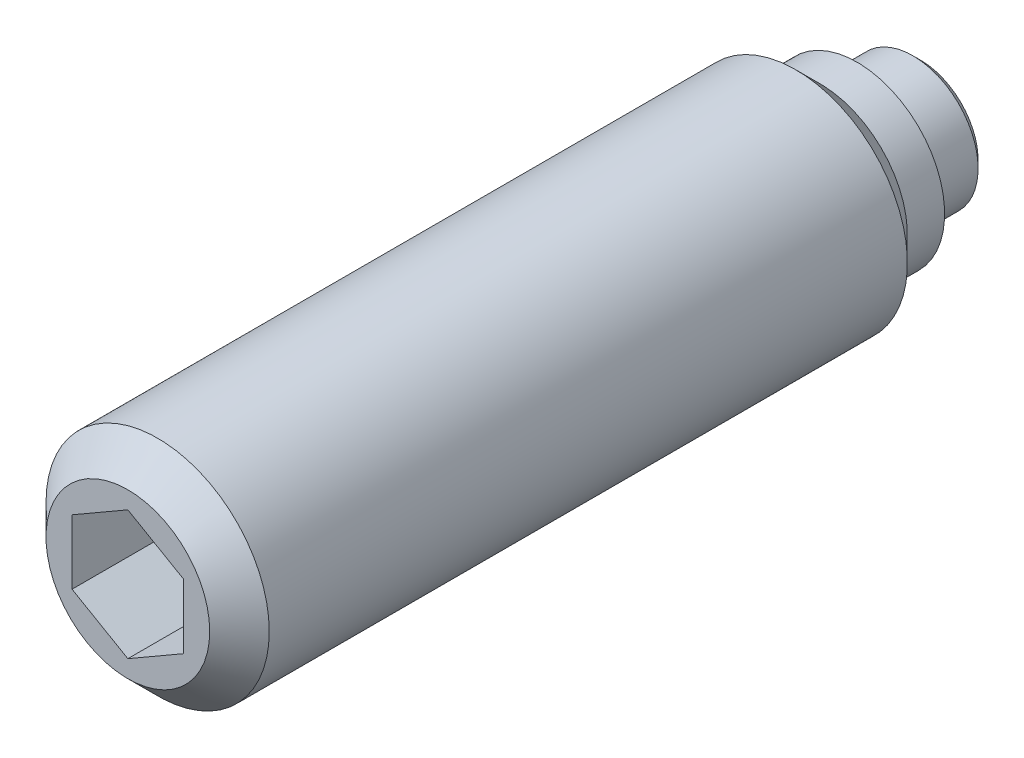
ISO-10303-21;
HEADER;
FILE_DESCRIPTION(('STEP AP214'),'2;1');
FILE_NAME('part.step','',(''),(''),'','','');
FILE_SCHEMA(('AUTOMOTIVE_DESIGN { 1 0 10303 214 1 1 1 1 }'));
ENDSEC;
DATA;
#1=APPLICATION_CONTEXT('core data for automotive mechanical design processes');
#2=APPLICATION_PROTOCOL_DEFINITION('international standard','automotive_design',2000,#1);
#3=PRODUCT_CONTEXT('',#1,'mechanical');
#4=PRODUCT('Part','Part','',(#3));
#5=PRODUCT_RELATED_PRODUCT_CATEGORY('part','',(#4));
#6=PRODUCT_DEFINITION_FORMATION('','',#4);
#7=PRODUCT_DEFINITION_CONTEXT('part definition',#1,'design');
#8=PRODUCT_DEFINITION('design','',#6,#7);
#9=PRODUCT_DEFINITION_SHAPE('','',#8);
#10=(LENGTH_UNIT() NAMED_UNIT(*) SI_UNIT(.MILLI.,.METRE.));
#11=(NAMED_UNIT(*) PLANE_ANGLE_UNIT() SI_UNIT($,.RADIAN.));
#12=(NAMED_UNIT(*) SI_UNIT($,.STERADIAN.) SOLID_ANGLE_UNIT());
#13=UNCERTAINTY_MEASURE_WITH_UNIT(LENGTH_MEASURE(1.E-05),#10,'distance_accuracy_value','');
#14=(GEOMETRIC_REPRESENTATION_CONTEXT(3) GLOBAL_UNCERTAINTY_ASSIGNED_CONTEXT((#13)) GLOBAL_UNIT_ASSIGNED_CONTEXT((#10,
#11,#12)) REPRESENTATION_CONTEXT('',''));
#15=CARTESIAN_POINT('',(0.,0.,0.));
#16=DIRECTION('',(0.,0.,1.));
#17=DIRECTION('',(1.,0.,0.));
#18=AXIS2_PLACEMENT_3D('',#15,#16,#17);
#19=CARTESIAN_POINT('',(0.,0.,0.));
#20=DIRECTION('',(0.,0.,-1.));
#21=DIRECTION('',(-1.,0.,0.));
#22=AXIS2_PLACEMENT_3D('',#19,#20,#21);
#23=CYLINDRICAL_SURFACE('',#22,1.75);
#24=CARTESIAN_POINT('',(0.,0.,0.2));
#25=DIRECTION('',(0.,0.,-1.));
#26=DIRECTION('',(-1.,0.,0.));
#27=AXIS2_PLACEMENT_3D('',#24,#25,#26);
#28=CIRCLE('',#27,1.75);
#29=CARTESIAN_POINT('',(-1.75,0.,0.2));
#30=VERTEX_POINT('',#29);
#31=EDGE_CURVE('E133',#30,#30,#28,.T.);
#32=ORIENTED_EDGE('',*,*,#31,.F.);
#33=EDGE_LOOP('',(#32));
#34=FACE_BOUND('',#33,.T.);
#35=CARTESIAN_POINT('',(0.,0.,1.7));
#36=DIRECTION('',(0.,0.,-1.));
#37=DIRECTION('',(-1.,0.,0.));
#38=AXIS2_PLACEMENT_3D('',#35,#36,#37);
#39=CIRCLE('',#38,1.75);
#40=CARTESIAN_POINT('',(-1.75,0.,1.7));
#41=VERTEX_POINT('',#40);
#42=EDGE_CURVE('E127',#41,#41,#39,.T.);
#43=ORIENTED_EDGE('',*,*,#42,.T.);
#44=EDGE_LOOP('',(#43));
#45=FACE_BOUND('',#44,.T.);
#46=ADVANCED_FACE('F14',(#34,#45),#23,.T.);
#47=CARTESIAN_POINT('',(0.,0.,0.2));
#48=DIRECTION('',(0.,0.,1.));
#49=DIRECTION('',(1.,0.,0.));
#50=AXIS2_PLACEMENT_3D('',#47,#48,#49);
#51=CONICAL_SURFACE('',#50,1.75,0.785398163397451);
#52=CARTESIAN_POINT('',(0.,0.,0.));
#53=DIRECTION('',(0.,0.,-1.));
#54=DIRECTION('',(-1.,0.,0.));
#55=AXIS2_PLACEMENT_3D('',#52,#53,#54);
#56=CIRCLE('',#55,1.55);
#57=CARTESIAN_POINT('',(-1.55,0.,0.));
#58=VERTEX_POINT('',#57);
#59=EDGE_CURVE('E130',#58,#58,#56,.T.);
#60=ORIENTED_EDGE('',*,*,#59,.F.);
#61=EDGE_LOOP('',(#60));
#62=FACE_BOUND('',#61,.T.);
#63=ORIENTED_EDGE('',*,*,#31,.T.);
#64=EDGE_LOOP('',(#63));
#65=FACE_BOUND('',#64,.T.);
#66=ADVANCED_FACE('F159',(#62,#65),#51,.T.);
#67=CARTESIAN_POINT('',(0.,1.55,0.));
#68=DIRECTION('',(0.,0.,1.));
#69=DIRECTION('',(1.,0.,0.));
#70=AXIS2_PLACEMENT_3D('',#67,#68,#69);
#71=PLANE('',#70);
#72=ORIENTED_EDGE('',*,*,#59,.T.);
#73=EDGE_LOOP('',(#72));
#74=FACE_BOUND('',#73,.T.);
#75=ADVANCED_FACE('F165',(#74),#71,.F.);
#76=CARTESIAN_POINT('',(0.,0.,1.7));
#77=DIRECTION('',(0.,0.,-1.));
#78=DIRECTION('',(-1.,0.,0.));
#79=AXIS2_PLACEMENT_3D('',#76,#77,#78);
#80=CYLINDRICAL_SURFACE('',#79,3.);
#81=CARTESIAN_POINT('',(0.,0.,3.35));
#82=DIRECTION('',(0.,0.,-1.));
#83=DIRECTION('',(-1.,0.,0.));
#84=AXIS2_PLACEMENT_3D('',#81,#82,#83);
#85=CIRCLE('',#84,3.);
#86=CARTESIAN_POINT('',(-3.,0.,3.35));
#87=VERTEX_POINT('',#86);
#88=EDGE_CURVE('E9',#87,#87,#85,.T.);
#89=ORIENTED_EDGE('',*,*,#88,.F.);
#90=EDGE_LOOP('',(#89));
#91=FACE_BOUND('',#90,.T.);
#92=CARTESIAN_POINT('',(0.,0.,20.5));
#93=DIRECTION('',(0.,0.,1.));
#94=DIRECTION('',(1.,0.,0.));
#95=AXIS2_PLACEMENT_3D('',#92,#93,#94);
#96=CIRCLE('',#95,3.);
#97=CARTESIAN_POINT('',(3.,0.,20.5));
#98=VERTEX_POINT('',#97);
#99=EDGE_CURVE('E124',#98,#98,#96,.T.);
#100=ORIENTED_EDGE('',*,*,#99,.F.);
#101=EDGE_LOOP('',(#100));
#102=FACE_BOUND('',#101,.T.);
#103=ADVANCED_FACE('F16',(#91,#102),#80,.T.);
#104=CARTESIAN_POINT('',(0.,2.35,1.7));
#105=DIRECTION('',(0.,0.,1.));
#106=DIRECTION('',(1.,0.,0.));
#107=AXIS2_PLACEMENT_3D('',#104,#105,#106);
#108=PLANE('',#107);
#109=CARTESIAN_POINT('',(0.,0.,1.7));
#110=DIRECTION('',(0.,0.,-1.));
#111=DIRECTION('',(-1.,0.,0.));
#112=AXIS2_PLACEMENT_3D('',#109,#110,#111);
#113=CIRCLE('',#112,2.35);
#114=CARTESIAN_POINT('',(-2.35,0.,1.7));
#115=VERTEX_POINT('',#114);
#116=EDGE_CURVE('E136',#115,#115,#113,.T.);
#117=ORIENTED_EDGE('',*,*,#116,.T.);
#118=EDGE_LOOP('',(#117));
#119=FACE_BOUND('',#118,.T.);
#120=ORIENTED_EDGE('',*,*,#42,.F.);
#121=EDGE_LOOP('',(#120));
#122=FACE_BOUND('',#121,.T.);
#123=ADVANCED_FACE('F156',(#119,#122),#108,.F.);
#124=CARTESIAN_POINT('',(0.,0.,1.7));
#125=DIRECTION('',(0.,0.,-1.));
#126=DIRECTION('',(-1.,0.,0.));
#127=AXIS2_PLACEMENT_3D('',#124,#125,#126);
#128=CYLINDRICAL_SURFACE('',#127,2.35);
#129=CARTESIAN_POINT('',(0.,0.,2.7));
#130=DIRECTION('',(0.,0.,-1.));
#131=DIRECTION('',(-1.,0.,0.));
#132=AXIS2_PLACEMENT_3D('',#129,#130,#131);
#133=CIRCLE('',#132,2.35);
#134=CARTESIAN_POINT('',(-2.35,0.,2.7));
#135=VERTEX_POINT('',#134);
#136=EDGE_CURVE('E22',#135,#135,#133,.T.);
#137=ORIENTED_EDGE('',*,*,#136,.T.);
#138=EDGE_LOOP('',(#137));
#139=FACE_BOUND('',#138,.T.);
#140=ORIENTED_EDGE('',*,*,#116,.F.);
#141=EDGE_LOOP('',(#140));
#142=FACE_BOUND('',#141,.T.);
#143=ADVANCED_FACE('F141',(#139,#142),#128,.T.);
#144=CARTESIAN_POINT('',(0.,0.,3.35));
#145=DIRECTION('',(0.,0.,1.));
#146=DIRECTION('',(1.,0.,0.));
#147=AXIS2_PLACEMENT_3D('',#144,#145,#146);
#148=CONICAL_SURFACE('',#147,3.,0.785398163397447);
#149=ORIENTED_EDGE('',*,*,#88,.T.);
#150=EDGE_LOOP('',(#149));
#151=FACE_BOUND('',#150,.T.);
#152=ORIENTED_EDGE('',*,*,#136,.F.);
#153=EDGE_LOOP('',(#152));
#154=FACE_BOUND('',#153,.T.);
#155=ADVANCED_FACE('F144',(#151,#154),#148,.T.);
#156=CARTESIAN_POINT('',(0.,-2.2,21.3));
#157=DIRECTION('',(0.,0.,1.));
#158=DIRECTION('',(1.,0.,0.));
#159=AXIS2_PLACEMENT_3D('',#156,#157,#158);
#160=PLANE('',#159);
#161=DIRECTION('',(0.866025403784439,-0.5,0.));
#162=VECTOR('',#161,1.);
#163=CARTESIAN_POINT('',(-1.5,-0.866025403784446,21.3));
#164=LINE('',#163,#162);
#165=CARTESIAN_POINT('',(-1.5,-0.866025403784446,21.3));
#166=VERTEX_POINT('',#165);
#167=CARTESIAN_POINT('',(0.,-1.73205080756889,21.3));
#168=VERTEX_POINT('',#167);
#169=EDGE_CURVE('E29',#166,#168,#164,.T.);
#170=ORIENTED_EDGE('',*,*,#169,.F.);
#171=DIRECTION('',(0.,-1.,0.));
#172=VECTOR('',#171,1.);
#173=CARTESIAN_POINT('',(-1.5,0.866025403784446,21.3));
#174=LINE('',#173,#172);
#175=CARTESIAN_POINT('',(-1.5,0.866025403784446,21.3));
#176=VERTEX_POINT('',#175);
#177=EDGE_CURVE('E112',#176,#166,#174,.T.);
#178=ORIENTED_EDGE('',*,*,#177,.F.);
#179=DIRECTION('',(-0.866025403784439,-0.5,0.));
#180=VECTOR('',#179,1.);
#181=CARTESIAN_POINT('',(0.,1.73205080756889,21.3));
#182=LINE('',#181,#180);
#183=CARTESIAN_POINT('',(0.,1.73205080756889,21.3));
#184=VERTEX_POINT('',#183);
#185=EDGE_CURVE('E110',#184,#176,#182,.T.);
#186=ORIENTED_EDGE('',*,*,#185,.F.);
#187=DIRECTION('',(-0.866025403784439,0.5,0.));
#188=VECTOR('',#187,1.);
#189=CARTESIAN_POINT('',(1.5,0.866025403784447,21.3));
#190=LINE('',#189,#188);
#191=CARTESIAN_POINT('',(1.5,0.866025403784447,21.3));
#192=VERTEX_POINT('',#191);
#193=EDGE_CURVE('E77',#192,#184,#190,.T.);
#194=ORIENTED_EDGE('',*,*,#193,.F.);
#195=DIRECTION('',(0.,1.,0.));
#196=VECTOR('',#195,1.);
#197=CARTESIAN_POINT('',(1.5,-0.866025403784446,21.3));
#198=LINE('',#197,#196);
#199=CARTESIAN_POINT('',(1.5,-0.866025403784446,21.3));
#200=VERTEX_POINT('',#199);
#201=EDGE_CURVE('E106',#200,#192,#198,.T.);
#202=ORIENTED_EDGE('',*,*,#201,.F.);
#203=DIRECTION('',(0.866025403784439,0.5,0.));
#204=VECTOR('',#203,1.);
#205=CARTESIAN_POINT('',(0.,-1.73205080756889,21.3));
#206=LINE('',#205,#204);
#207=EDGE_CURVE('E103',#168,#200,#206,.T.);
#208=ORIENTED_EDGE('',*,*,#207,.F.);
#209=EDGE_LOOP('',(#170,#178,#186,#194,#202,#208));
#210=FACE_BOUND('',#209,.T.);
#211=CARTESIAN_POINT('',(0.,0.,21.3));
#212=DIRECTION('',(0.,0.,1.));
#213=DIRECTION('',(1.,0.,0.));
#214=AXIS2_PLACEMENT_3D('',#211,#212,#213);
#215=CIRCLE('',#214,2.2);
#216=CARTESIAN_POINT('',(2.2,0.,21.3));
#217=VERTEX_POINT('',#216);
#218=EDGE_CURVE('E116',#217,#217,#215,.T.);
#219=ORIENTED_EDGE('',*,*,#218,.T.);
#220=EDGE_LOOP('',(#219));
#221=FACE_BOUND('',#220,.T.);
#222=ADVANCED_FACE('F146',(#210,#221),#160,.T.);
#223=CARTESIAN_POINT('',(0.,0.,21.3));
#224=DIRECTION('',(0.,0.,-1.));
#225=DIRECTION('',(-1.,0.,0.));
#226=AXIS2_PLACEMENT_3D('',#223,#224,#225);
#227=CONICAL_SURFACE('',#226,2.2,0.785398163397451);
#228=ORIENTED_EDGE('',*,*,#99,.T.);
#229=EDGE_LOOP('',(#228));
#230=FACE_BOUND('',#229,.T.);
#231=ORIENTED_EDGE('',*,*,#218,.F.);
#232=EDGE_LOOP('',(#231));
#233=FACE_BOUND('',#232,.T.);
#234=ADVANCED_FACE('F153',(#230,#233),#227,.T.);
#235=CARTESIAN_POINT('',(-1.5,-0.866025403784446,17.8));
#236=DIRECTION('',(-0.5,-0.866025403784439,0.));
#237=DIRECTION('',(0.866025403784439,-0.5,0.));
#238=AXIS2_PLACEMENT_3D('',#235,#236,#237);
#239=PLANE('',#238);
#240=ORIENTED_EDGE('',*,*,#169,.T.);
#241=DIRECTION('',(0.,0.,1.));
#242=VECTOR('',#241,1.);
#243=CARTESIAN_POINT('',(0.,-1.73205080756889,17.8));
#244=LINE('',#243,#242);
#245=CARTESIAN_POINT('',(0.,-1.73205080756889,17.8));
#246=VERTEX_POINT('',#245);
#247=EDGE_CURVE('E59',#246,#168,#244,.T.);
#248=ORIENTED_EDGE('',*,*,#247,.F.);
#249=DIRECTION('',(0.866025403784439,-0.5,0.));
#250=VECTOR('',#249,1.);
#251=CARTESIAN_POINT('',(-1.5,-0.866025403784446,17.8));
#252=LINE('',#251,#250);
#253=CARTESIAN_POINT('',(-1.5,-0.866025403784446,17.8));
#254=VERTEX_POINT('',#253);
#255=EDGE_CURVE('E114',#254,#246,#252,.T.);
#256=ORIENTED_EDGE('',*,*,#255,.F.);
#257=DIRECTION('',(0.,0.,1.));
#258=VECTOR('',#257,1.);
#259=CARTESIAN_POINT('',(-1.5,-0.866025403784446,17.8));
#260=LINE('',#259,#258);
#261=EDGE_CURVE('E37',#254,#166,#260,.T.);
#262=ORIENTED_EDGE('',*,*,#261,.T.);
#263=EDGE_LOOP('',(#240,#248,#256,#262));
#264=FACE_BOUND('',#263,.T.);
#265=ADVANCED_FACE('F191',(#264),#239,.F.);
#266=CARTESIAN_POINT('',(-1.5,0.866025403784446,17.8));
#267=DIRECTION('',(-1.,0.,0.));
#268=DIRECTION('',(0.,0.,1.));
#269=AXIS2_PLACEMENT_3D('',#266,#267,#268);
#270=PLANE('',#269);
#271=ORIENTED_EDGE('',*,*,#177,.T.);
#272=ORIENTED_EDGE('',*,*,#261,.F.);
#273=DIRECTION('',(0.,-1.,0.));
#274=VECTOR('',#273,1.);
#275=CARTESIAN_POINT('',(-1.5,0.866025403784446,17.8));
#276=LINE('',#275,#274);
#277=CARTESIAN_POINT('',(-1.5,0.866025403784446,17.8));
#278=VERTEX_POINT('',#277);
#279=EDGE_CURVE('E89',#278,#254,#276,.T.);
#280=ORIENTED_EDGE('',*,*,#279,.F.);
#281=DIRECTION('',(0.,0.,1.));
#282=VECTOR('',#281,1.);
#283=CARTESIAN_POINT('',(-1.5,0.866025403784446,17.8));
#284=LINE('',#283,#282);
#285=EDGE_CURVE('E81',#278,#176,#284,.T.);
#286=ORIENTED_EDGE('',*,*,#285,.T.);
#287=EDGE_LOOP('',(#271,#272,#280,#286));
#288=FACE_BOUND('',#287,.T.);
#289=ADVANCED_FACE('F198',(#288),#270,.F.);
#290=CARTESIAN_POINT('',(0.,1.73205080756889,17.8));
#291=DIRECTION('',(-0.5,0.866025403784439,0.));
#292=DIRECTION('',(-0.866025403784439,-0.5,0.));
#293=AXIS2_PLACEMENT_3D('',#290,#291,#292);
#294=PLANE('',#293);
#295=ORIENTED_EDGE('',*,*,#185,.T.);
#296=ORIENTED_EDGE('',*,*,#285,.F.);
#297=DIRECTION('',(-0.866025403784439,-0.5,0.));
#298=VECTOR('',#297,1.);
#299=CARTESIAN_POINT('',(0.,1.73205080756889,17.8));
#300=LINE('',#299,#298);
#301=CARTESIAN_POINT('',(0.,1.73205080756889,17.8));
#302=VERTEX_POINT('',#301);
#303=EDGE_CURVE('E85',#302,#278,#300,.T.);
#304=ORIENTED_EDGE('',*,*,#303,.F.);
#305=DIRECTION('',(0.,0.,1.));
#306=VECTOR('',#305,1.);
#307=CARTESIAN_POINT('',(0.,1.73205080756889,17.8));
#308=LINE('',#307,#306);
#309=EDGE_CURVE('E70',#302,#184,#308,.T.);
#310=ORIENTED_EDGE('',*,*,#309,.T.);
#311=EDGE_LOOP('',(#295,#296,#304,#310));
#312=FACE_BOUND('',#311,.T.);
#313=ADVANCED_FACE('F86',(#312),#294,.F.);
#314=CARTESIAN_POINT('',(1.5,0.866025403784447,17.8));
#315=DIRECTION('',(0.5,0.866025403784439,0.));
#316=DIRECTION('',(-0.866025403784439,0.5,0.));
#317=AXIS2_PLACEMENT_3D('',#314,#315,#316);
#318=PLANE('',#317);
#319=ORIENTED_EDGE('',*,*,#193,.T.);
#320=ORIENTED_EDGE('',*,*,#309,.F.);
#321=DIRECTION('',(-0.866025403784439,0.5,0.));
#322=VECTOR('',#321,1.);
#323=CARTESIAN_POINT('',(1.5,0.866025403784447,17.8));
#324=LINE('',#323,#322);
#325=CARTESIAN_POINT('',(1.5,0.866025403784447,17.8));
#326=VERTEX_POINT('',#325);
#327=EDGE_CURVE('E74',#326,#302,#324,.T.);
#328=ORIENTED_EDGE('',*,*,#327,.F.);
#329=DIRECTION('',(0.,0.,1.));
#330=VECTOR('',#329,1.);
#331=CARTESIAN_POINT('',(1.5,0.866025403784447,17.8));
#332=LINE('',#331,#330);
#333=EDGE_CURVE('E82',#326,#192,#332,.T.);
#334=ORIENTED_EDGE('',*,*,#333,.T.);
#335=EDGE_LOOP('',(#319,#320,#328,#334));
#336=FACE_BOUND('',#335,.T.);
#337=ADVANCED_FACE('F72',(#336),#318,.F.);
#338=CARTESIAN_POINT('',(1.5,-0.866025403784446,17.8));
#339=DIRECTION('',(1.,0.,0.));
#340=DIRECTION('',(0.,1.,0.));
#341=AXIS2_PLACEMENT_3D('',#338,#339,#340);
#342=PLANE('',#341);
#343=ORIENTED_EDGE('',*,*,#201,.T.);
#344=ORIENTED_EDGE('',*,*,#333,.F.);
#345=DIRECTION('',(0.,1.,0.));
#346=VECTOR('',#345,1.);
#347=CARTESIAN_POINT('',(1.5,-0.866025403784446,17.8));
#348=LINE('',#347,#346);
#349=CARTESIAN_POINT('',(1.5,-0.866025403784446,17.8));
#350=VERTEX_POINT('',#349);
#351=EDGE_CURVE('E95',#350,#326,#348,.T.);
#352=ORIENTED_EDGE('',*,*,#351,.F.);
#353=DIRECTION('',(0.,0.,1.));
#354=VECTOR('',#353,1.);
#355=CARTESIAN_POINT('',(1.5,-0.866025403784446,17.8));
#356=LINE('',#355,#354);
#357=EDGE_CURVE('E119',#350,#200,#356,.T.);
#358=ORIENTED_EDGE('',*,*,#357,.T.);
#359=EDGE_LOOP('',(#343,#344,#352,#358));
#360=FACE_BOUND('',#359,.T.);
#361=ADVANCED_FACE('F204',(#360),#342,.F.);
#362=CARTESIAN_POINT('',(0.,-1.73205080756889,17.8));
#363=DIRECTION('',(0.5,-0.866025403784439,0.));
#364=DIRECTION('',(0.866025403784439,0.5,0.));
#365=AXIS2_PLACEMENT_3D('',#362,#363,#364);
#366=PLANE('',#365);
#367=ORIENTED_EDGE('',*,*,#207,.T.);
#368=ORIENTED_EDGE('',*,*,#357,.F.);
#369=DIRECTION('',(0.866025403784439,0.5,0.));
#370=VECTOR('',#369,1.);
#371=CARTESIAN_POINT('',(0.,-1.73205080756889,17.8));
#372=LINE('',#371,#370);
#373=EDGE_CURVE('E97',#246,#350,#372,.T.);
#374=ORIENTED_EDGE('',*,*,#373,.F.);
#375=ORIENTED_EDGE('',*,*,#247,.T.);
#376=EDGE_LOOP('',(#367,#368,#374,#375));
#377=FACE_BOUND('',#376,.T.);
#378=ADVANCED_FACE('F201',(#377),#366,.F.);
#379=CARTESIAN_POINT('',(0.,0.,17.8));
#380=DIRECTION('',(0.,0.,1.));
#381=DIRECTION('',(1.,0.,0.));
#382=AXIS2_PLACEMENT_3D('',#379,#380,#381);
#383=PLANE('',#382);
#384=ORIENTED_EDGE('',*,*,#255,.T.);
#385=ORIENTED_EDGE('',*,*,#373,.T.);
#386=ORIENTED_EDGE('',*,*,#351,.T.);
#387=ORIENTED_EDGE('',*,*,#327,.T.);
#388=ORIENTED_EDGE('',*,*,#303,.T.);
#389=ORIENTED_EDGE('',*,*,#279,.T.);
#390=EDGE_LOOP('',(#384,#385,#386,#387,#388,#389));
#391=FACE_BOUND('',#390,.T.);
#392=ADVANCED_FACE('F92',(#391),#383,.T.);
#393=CLOSED_SHELL('',(#46,#66,#75,#103,#123,#143,#155,#222,#234,#265,#289,#313,#337,#361,#378,#392));
#394=MANIFOLD_SOLID_BREP('B1',#393);
#395=ADVANCED_BREP_SHAPE_REPRESENTATION('',(#18,#394),#14);
#396=SHAPE_DEFINITION_REPRESENTATION(#9,#395);
ENDSEC;
END-ISO-10303-21;
